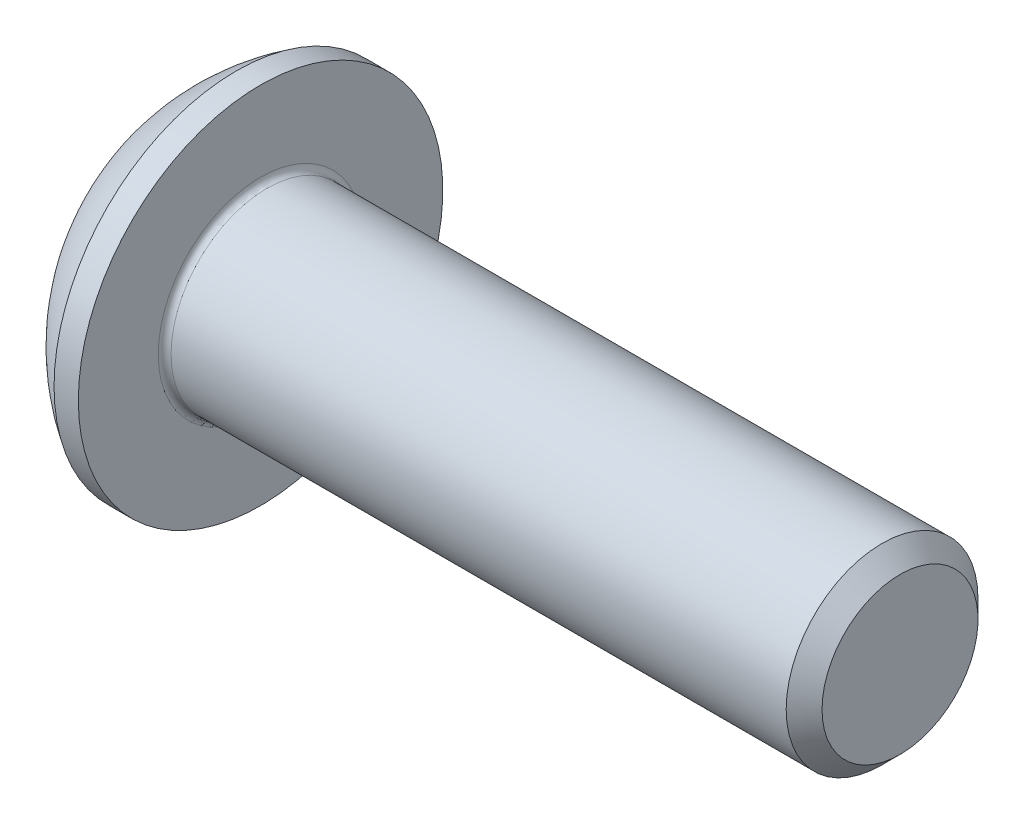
from build123d import *

# Parameters (mm, degrees)
FILLET1_R   = 0.1
HEX_2_DEPTH = 1.04


with BuildPart() as part:
    # BodySke → BaseBody (revolve)
    with BuildSketch(Plane.XY, mode=Mode.PRIVATE) as basebody_sk:
        with BuildLine():
            Line((11.65, 0), (11.65, 1.2195))
            Line((11.65, 1.2195), (11.3695, 1.5))
            Line((11.3695, 1.5), (1.65, 1.5))
            Line((1.65, 1.5), (1.65, 2.85))
            Line((1.65, 2.85), (1.27, 2.85))
            ThreePointArc((1.27, 2.85), (0.53140404, 2.229827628), (0, 1.425))
            Line((0, 1.425), (0, 0))
            Line((0, 0), (11.65, 0))
        make_face()
    revolve(basebody_sk.sketch.rotate(Axis((0, 0, 0), (1, 0, 0)), 90), axis=Axis((0, 0, 0), (1, 0, 0)))

    # Fillet1
    fillet1_edges = [part.edges().sort_by_distance(p)[0] for p in [
        (1.65, 0, -1.5),
    ]]
    fillet(fillet1_edges, radius=FILLET1_R)

    # Sketch2 → PreBroach (revolve, cut)
    with BuildSketch(Plane.XY, mode=Mode.PRIVATE) as prebroach_sk:
        Polygon((0, 1), (1.04, 1), (1.617350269, 0), (0, 0), align=None)
    revolve(prebroach_sk.sketch.rotate(Axis((0, 0, 0), (1, 0, 0)), 90), axis=Axis((0, 0, 0), (1, 0, 0)), mode=Mode.SUBTRACT)

    # Sketch3 → Hex 2 (cut)
    with BuildSketch(Plane(origin=(0, 0, 0), x_dir=(0, 0, -1), z_dir=(1, 0, 0))):
        Polygon((-1, -0.577350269), (-1, 0.577350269), (0, 1.154700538), (1, 0.577350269), (1, -0.577350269), (0, -1.154700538), align=None)
    extrude(amount=HEX_2_DEPTH, mode=Mode.SUBTRACT)


solid = part.part
